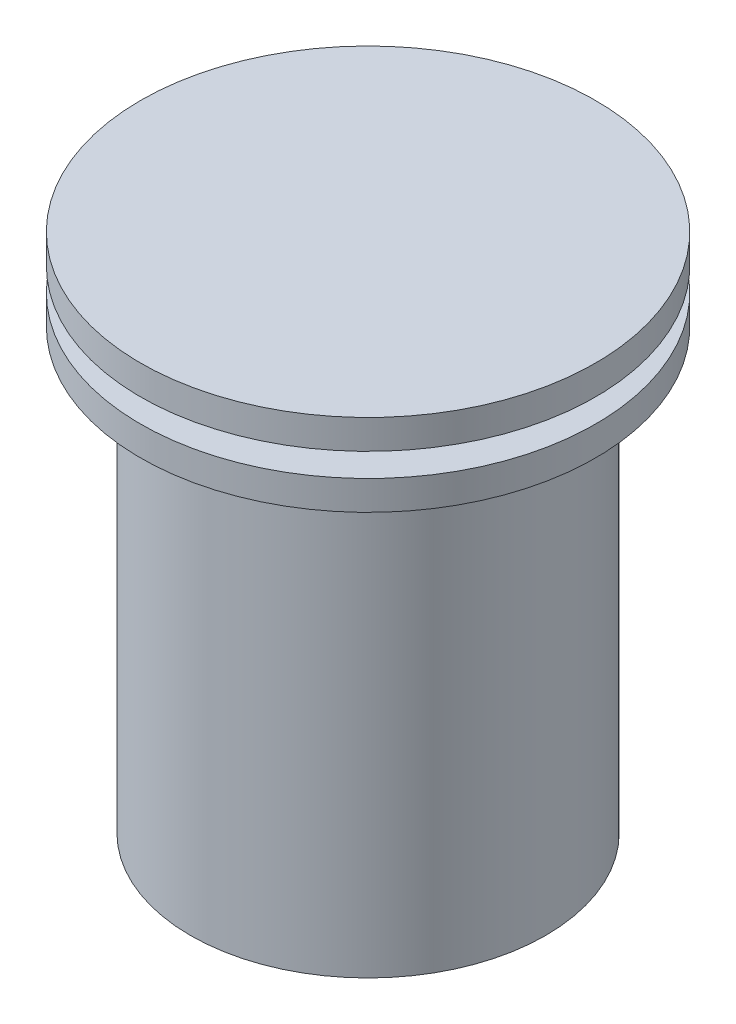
from build123d import *


with BuildPart() as part:
    # Croquis1 → Revoluci_n1 (revolve)
    with BuildSketch(Plane.XY, mode=Mode.PRIVATE) as revoluci_n1_sk:
        with BuildLine():
            Line((0, 135.53878055), (0, -57.46121945))
            ThreePointArc((0, -57.46121945), (31.241499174, -53.494143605), (60.5, -41.84471912))
            Line((60.5, -41.84471912), (60.5, 107.53878055))
            Line((60.5, 107.53878055), (77.5, 107.53878055))
            Line((77.5, 107.53878055), (77.5, 117.53878055))
            Line((77.5, 117.53878055), (60.5, 117.53878055))
            Line((60.5, 117.53878055), (60.5, 125.53878055))
            Line((60.5, 125.53878055), (77.5, 125.53878055))
            Line((77.5, 125.53878055), (77.5, 135.53878055))
            Line((77.5, 135.53878055), (0, 135.53878055))
        make_face()
    revolve(revoluci_n1_sk.sketch.rotate(Axis((0, 135.53878055, 0), (0, -1, 0)), 180), axis=Axis((0, 135.53878055, 0), (0, -1, 0)))


solid = part.part
